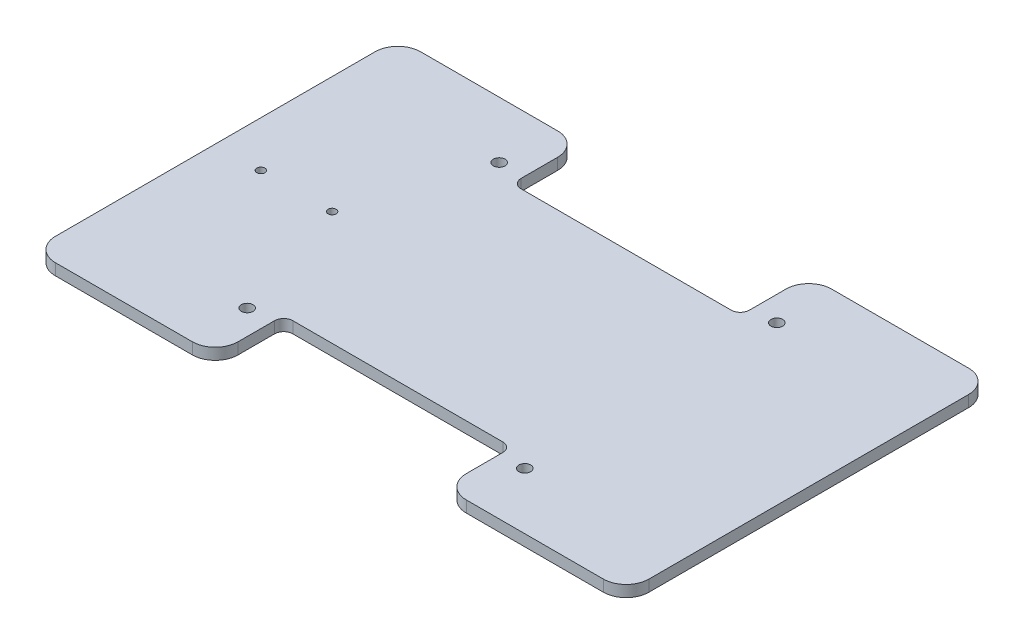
ISO-10303-21;
HEADER;
FILE_DESCRIPTION(('STEP AP214'),'2;1');
FILE_NAME('part.step','',(''),(''),'','','');
FILE_SCHEMA(('AUTOMOTIVE_DESIGN { 1 0 10303 214 1 1 1 1 }'));
ENDSEC;
DATA;
#1=APPLICATION_CONTEXT('core data for automotive mechanical design processes');
#2=APPLICATION_PROTOCOL_DEFINITION('international standard','automotive_design',2000,#1);
#3=PRODUCT_CONTEXT('',#1,'mechanical');
#4=PRODUCT('Part','Part','',(#3));
#5=PRODUCT_RELATED_PRODUCT_CATEGORY('part','',(#4));
#6=PRODUCT_DEFINITION_FORMATION('','',#4);
#7=PRODUCT_DEFINITION_CONTEXT('part definition',#1,'design');
#8=PRODUCT_DEFINITION('design','',#6,#7);
#9=PRODUCT_DEFINITION_SHAPE('','',#8);
#10=(LENGTH_UNIT() NAMED_UNIT(*) SI_UNIT(.MILLI.,.METRE.));
#11=(NAMED_UNIT(*) PLANE_ANGLE_UNIT() SI_UNIT($,.RADIAN.));
#12=(NAMED_UNIT(*) SI_UNIT($,.STERADIAN.) SOLID_ANGLE_UNIT());
#13=UNCERTAINTY_MEASURE_WITH_UNIT(LENGTH_MEASURE(1.E-05),#10,'distance_accuracy_value','');
#14=(GEOMETRIC_REPRESENTATION_CONTEXT(3) GLOBAL_UNCERTAINTY_ASSIGNED_CONTEXT((#13)) GLOBAL_UNIT_ASSIGNED_CONTEXT((#10,
#11,#12)) REPRESENTATION_CONTEXT('',''));
#15=CARTESIAN_POINT('',(0.,0.,0.));
#16=DIRECTION('',(0.,0.,1.));
#17=DIRECTION('',(1.,0.,0.));
#18=AXIS2_PLACEMENT_3D('',#15,#16,#17);
#19=CARTESIAN_POINT('',(-82.55,3.175,50.8));
#20=DIRECTION('',(0.,0.,-1.));
#21=DIRECTION('',(-1.,0.,0.));
#22=AXIS2_PLACEMENT_3D('',#19,#20,#21);
#23=PLANE('',#22);
#24=DIRECTION('',(0.,1.,0.));
#25=VECTOR('',#24,1.);
#26=CARTESIAN_POINT('',(-38.1,0.,50.8));
#27=LINE('',#26,#25);
#28=CARTESIAN_POINT('',(-38.1,0.,50.8));
#29=VERTEX_POINT('',#28);
#30=CARTESIAN_POINT('',(-38.1,3.175,50.8));
#31=VERTEX_POINT('',#30);
#32=EDGE_CURVE('E194',#29,#31,#27,.T.);
#33=ORIENTED_EDGE('',*,*,#32,.T.);
#34=DIRECTION('',(1.,0.,0.));
#35=VECTOR('',#34,1.);
#36=CARTESIAN_POINT('',(-82.55,3.175,50.8));
#37=LINE('',#36,#35);
#38=CARTESIAN_POINT('',(-76.2,3.175,50.8));
#39=VERTEX_POINT('',#38);
#40=EDGE_CURVE('E232',#39,#31,#37,.T.);
#41=ORIENTED_EDGE('',*,*,#40,.F.);
#42=DIRECTION('',(0.,-1.,0.));
#43=VECTOR('',#42,1.);
#44=CARTESIAN_POINT('',(-76.2,3.175,50.8));
#45=LINE('',#44,#43);
#46=CARTESIAN_POINT('',(-76.2,0.,50.8));
#47=VERTEX_POINT('',#46);
#48=EDGE_CURVE('E11',#39,#47,#45,.T.);
#49=ORIENTED_EDGE('',*,*,#48,.T.);
#50=DIRECTION('',(1.,0.,0.));
#51=VECTOR('',#50,1.);
#52=CARTESIAN_POINT('',(-82.55,0.,50.8));
#53=LINE('',#52,#51);
#54=EDGE_CURVE('E212',#47,#29,#53,.T.);
#55=ORIENTED_EDGE('',*,*,#54,.T.);
#56=EDGE_LOOP('',(#33,#41,#49,#55));
#57=FACE_BOUND('',#56,.T.);
#58=ADVANCED_FACE('F33',(#57),#23,.F.);
#59=CARTESIAN_POINT('',(-82.55,3.175,-50.8));
#60=DIRECTION('',(0.,0.,1.));
#61=DIRECTION('',(1.,0.,0.));
#62=AXIS2_PLACEMENT_3D('',#59,#60,#61);
#63=PLANE('',#62);
#64=DIRECTION('',(0.,1.,0.));
#65=VECTOR('',#64,1.);
#66=CARTESIAN_POINT('',(38.1,0.,-50.8));
#67=LINE('',#66,#65);
#68=CARTESIAN_POINT('',(38.1,0.,-50.8));
#69=VERTEX_POINT('',#68);
#70=CARTESIAN_POINT('',(38.1,3.175,-50.8));
#71=VERTEX_POINT('',#70);
#72=EDGE_CURVE('E297',#69,#71,#67,.T.);
#73=ORIENTED_EDGE('',*,*,#72,.T.);
#74=DIRECTION('',(-1.,0.,0.));
#75=VECTOR('',#74,1.);
#76=CARTESIAN_POINT('',(-82.55,3.175,-50.8));
#77=LINE('',#76,#75);
#78=CARTESIAN_POINT('',(76.2,3.175,-50.8));
#79=VERTEX_POINT('',#78);
#80=EDGE_CURVE('E291',#79,#71,#77,.T.);
#81=ORIENTED_EDGE('',*,*,#80,.F.);
#82=DIRECTION('',(0.,-1.,0.));
#83=VECTOR('',#82,1.);
#84=CARTESIAN_POINT('',(76.2,3.175,-50.8));
#85=LINE('',#84,#83);
#86=CARTESIAN_POINT('',(76.2,0.,-50.8));
#87=VERTEX_POINT('',#86);
#88=EDGE_CURVE('E245',#79,#87,#85,.T.);
#89=ORIENTED_EDGE('',*,*,#88,.T.);
#90=DIRECTION('',(-1.,0.,0.));
#91=VECTOR('',#90,1.);
#92=CARTESIAN_POINT('',(-82.55,0.,-50.8));
#93=LINE('',#92,#91);
#94=EDGE_CURVE('E307',#87,#69,#93,.T.);
#95=ORIENTED_EDGE('',*,*,#94,.T.);
#96=EDGE_LOOP('',(#73,#81,#89,#95));
#97=FACE_BOUND('',#96,.T.);
#98=ADVANCED_FACE('F294',(#97),#63,.F.);
#99=CARTESIAN_POINT('',(82.55,3.175,50.8));
#100=DIRECTION('',(-1.,0.,0.));
#101=DIRECTION('',(0.,0.,1.));
#102=AXIS2_PLACEMENT_3D('',#99,#100,#101);
#103=PLANE('',#102);
#104=DIRECTION('',(0.,0.,-1.));
#105=VECTOR('',#104,1.);
#106=CARTESIAN_POINT('',(82.55,0.,50.8));
#107=LINE('',#106,#105);
#108=CARTESIAN_POINT('',(82.55,0.,44.45));
#109=VERTEX_POINT('',#108);
#110=CARTESIAN_POINT('',(82.55,0.,-44.45));
#111=VERTEX_POINT('',#110);
#112=EDGE_CURVE('E284',#109,#111,#107,.T.);
#113=ORIENTED_EDGE('',*,*,#112,.T.);
#114=DIRECTION('',(0.,-1.,0.));
#115=VECTOR('',#114,1.);
#116=CARTESIAN_POINT('',(82.55,3.175,-44.45));
#117=LINE('',#116,#115);
#118=CARTESIAN_POINT('',(82.55,3.175,-44.45));
#119=VERTEX_POINT('',#118);
#120=EDGE_CURVE('E262',#111,#119,#117,.F.);
#121=ORIENTED_EDGE('',*,*,#120,.T.);
#122=DIRECTION('',(0.,0.,-1.));
#123=VECTOR('',#122,1.);
#124=CARTESIAN_POINT('',(82.55,3.175,50.8));
#125=LINE('',#124,#123);
#126=CARTESIAN_POINT('',(82.55,3.175,44.45));
#127=VERTEX_POINT('',#126);
#128=EDGE_CURVE('E219',#127,#119,#125,.T.);
#129=ORIENTED_EDGE('',*,*,#128,.F.);
#130=DIRECTION('',(0.,-1.,0.));
#131=VECTOR('',#130,1.);
#132=CARTESIAN_POINT('',(82.55,3.175,44.45));
#133=LINE('',#132,#131);
#134=EDGE_CURVE('E259',#127,#109,#133,.T.);
#135=ORIENTED_EDGE('',*,*,#134,.T.);
#136=EDGE_LOOP('',(#113,#121,#129,#135));
#137=FACE_BOUND('',#136,.T.);
#138=ADVANCED_FACE('F281',(#137),#103,.F.);
#139=CARTESIAN_POINT('',(-38.1,3.175,-50.8));
#140=VERTEX_POINT('',#139);
#141=CARTESIAN_POINT('',(-76.2,3.175,-50.8));
#142=VERTEX_POINT('',#141);
#143=EDGE_CURVE('E223',#140,#142,#77,.T.);
#144=ORIENTED_EDGE('',*,*,#143,.F.);
#145=DIRECTION('',(0.,1.,0.));
#146=VECTOR('',#145,1.);
#147=CARTESIAN_POINT('',(-38.1,0.,-50.8));
#148=LINE('',#147,#146);
#149=CARTESIAN_POINT('',(-38.1,0.,-50.8));
#150=VERTEX_POINT('',#149);
#151=EDGE_CURVE('E316',#150,#140,#148,.T.);
#152=ORIENTED_EDGE('',*,*,#151,.F.);
#153=CARTESIAN_POINT('',(-76.2,0.,-50.8));
#154=VERTEX_POINT('',#153);
#155=EDGE_CURVE('E305',#150,#154,#93,.T.);
#156=ORIENTED_EDGE('',*,*,#155,.T.);
#157=DIRECTION('',(0.,-1.,0.));
#158=VECTOR('',#157,1.);
#159=CARTESIAN_POINT('',(-76.2,3.175,-50.8));
#160=LINE('',#159,#158);
#161=EDGE_CURVE('E248',#154,#142,#160,.F.);
#162=ORIENTED_EDGE('',*,*,#161,.T.);
#163=EDGE_LOOP('',(#144,#152,#156,#162));
#164=FACE_BOUND('',#163,.T.);
#165=ADVANCED_FACE('F313',(#164),#63,.F.);
#166=CARTESIAN_POINT('',(-82.55,3.175,50.8));
#167=DIRECTION('',(1.,0.,0.));
#168=DIRECTION('',(0.,0.,-1.));
#169=AXIS2_PLACEMENT_3D('',#166,#167,#168);
#170=PLANE('',#169);
#171=DIRECTION('',(0.,0.,1.));
#172=VECTOR('',#171,1.);
#173=CARTESIAN_POINT('',(-82.55,3.175,50.8));
#174=LINE('',#173,#172);
#175=CARTESIAN_POINT('',(-82.55,3.175,-44.45));
#176=VERTEX_POINT('',#175);
#177=CARTESIAN_POINT('',(-82.55,3.175,44.45));
#178=VERTEX_POINT('',#177);
#179=EDGE_CURVE('E298',#176,#178,#174,.T.);
#180=ORIENTED_EDGE('',*,*,#179,.F.);
#181=DIRECTION('',(0.,-1.,0.));
#182=VECTOR('',#181,1.);
#183=CARTESIAN_POINT('',(-82.55,3.175,-44.45));
#184=LINE('',#183,#182);
#185=CARTESIAN_POINT('',(-82.55,0.,-44.45));
#186=VERTEX_POINT('',#185);
#187=EDGE_CURVE('E231',#176,#186,#184,.T.);
#188=ORIENTED_EDGE('',*,*,#187,.T.);
#189=DIRECTION('',(0.,0.,1.));
#190=VECTOR('',#189,1.);
#191=CARTESIAN_POINT('',(-82.55,0.,50.8));
#192=LINE('',#191,#190);
#193=CARTESIAN_POINT('',(-82.55,0.,44.45));
#194=VERTEX_POINT('',#193);
#195=EDGE_CURVE('E225',#186,#194,#192,.T.);
#196=ORIENTED_EDGE('',*,*,#195,.T.);
#197=DIRECTION('',(0.,-1.,0.));
#198=VECTOR('',#197,1.);
#199=CARTESIAN_POINT('',(-82.55,3.175,44.45));
#200=LINE('',#199,#198);
#201=EDGE_CURVE('E229',#194,#178,#200,.F.);
#202=ORIENTED_EDGE('',*,*,#201,.T.);
#203=EDGE_LOOP('',(#180,#188,#196,#202));
#204=FACE_BOUND('',#203,.T.);
#205=ADVANCED_FACE('F326',(#204),#170,.F.);
#206=CARTESIAN_POINT('',(38.1,3.175,50.8));
#207=VERTEX_POINT('',#206);
#208=CARTESIAN_POINT('',(76.2,3.175,50.8));
#209=VERTEX_POINT('',#208);
#210=EDGE_CURVE('E270',#207,#209,#37,.T.);
#211=ORIENTED_EDGE('',*,*,#210,.F.);
#212=DIRECTION('',(0.,1.,0.));
#213=VECTOR('',#212,1.);
#214=CARTESIAN_POINT('',(38.1,0.,50.8));
#215=LINE('',#214,#213);
#216=CARTESIAN_POINT('',(38.1,0.,50.8));
#217=VERTEX_POINT('',#216);
#218=EDGE_CURVE('E205',#217,#207,#215,.T.);
#219=ORIENTED_EDGE('',*,*,#218,.F.);
#220=CARTESIAN_POINT('',(76.2,0.,50.8));
#221=VERTEX_POINT('',#220);
#222=EDGE_CURVE('E220',#217,#221,#53,.T.);
#223=ORIENTED_EDGE('',*,*,#222,.T.);
#224=DIRECTION('',(0.,-1.,0.));
#225=VECTOR('',#224,1.);
#226=CARTESIAN_POINT('',(76.2,3.175,50.8));
#227=LINE('',#226,#225);
#228=EDGE_CURVE('E41',#221,#209,#227,.F.);
#229=ORIENTED_EDGE('',*,*,#228,.T.);
#230=EDGE_LOOP('',(#211,#219,#223,#229));
#231=FACE_BOUND('',#230,.T.);
#232=ADVANCED_FACE('F268',(#231),#23,.F.);
#233=CARTESIAN_POINT('',(0.,3.175,0.));
#234=DIRECTION('',(0.,-1.,0.));
#235=DIRECTION('',(0.,0.,-1.));
#236=AXIS2_PLACEMENT_3D('',#233,#234,#235);
#237=PLANE('',#236);
#238=CARTESIAN_POINT('',(-69.85,3.175,0.));
#239=DIRECTION('',(0.,1.,0.));
#240=DIRECTION('',(0.,0.,1.));
#241=AXIS2_PLACEMENT_3D('',#238,#239,#240);
#242=CIRCLE('',#241,1.1303);
#243=CARTESIAN_POINT('',(-69.85,3.175,1.1303));
#244=VERTEX_POINT('',#243);
#245=EDGE_CURVE('E745',#244,#244,#242,.T.);
#246=ORIENTED_EDGE('',*,*,#245,.F.);
#247=EDGE_LOOP('',(#246));
#248=FACE_BOUND('',#247,.T.);
#249=CARTESIAN_POINT('',(-50.038,3.175,0.));
#250=DIRECTION('',(0.,1.,0.));
#251=DIRECTION('',(0.,0.,1.));
#252=AXIS2_PLACEMENT_3D('',#249,#250,#251);
#253=CIRCLE('',#252,1.1303);
#254=CARTESIAN_POINT('',(-50.038,3.175,1.1303));
#255=VERTEX_POINT('',#254);
#256=EDGE_CURVE('E340',#255,#255,#253,.T.);
#257=ORIENTED_EDGE('',*,*,#256,.F.);
#258=EDGE_LOOP('',(#257));
#259=FACE_BOUND('',#258,.T.);
#260=CARTESIAN_POINT('',(-38.608,3.175,-35.052));
#261=DIRECTION('',(0.,1.,0.));
#262=DIRECTION('',(0.,0.,1.));
#263=AXIS2_PLACEMENT_3D('',#260,#261,#262);
#264=CIRCLE('',#263,1.63194999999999);
#265=CARTESIAN_POINT('',(-38.608,3.175,-33.42005));
#266=VERTEX_POINT('',#265);
#267=EDGE_CURVE('E410',#266,#266,#264,.T.);
#268=ORIENTED_EDGE('',*,*,#267,.F.);
#269=EDGE_LOOP('',(#268));
#270=FACE_BOUND('',#269,.T.);
#271=CARTESIAN_POINT('',(38.6079999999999,3.175,-35.052));
#272=DIRECTION('',(0.,1.,0.));
#273=DIRECTION('',(0.,0.,1.));
#274=AXIS2_PLACEMENT_3D('',#271,#272,#273);
#275=CIRCLE('',#274,1.63194999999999);
#276=CARTESIAN_POINT('',(38.6079999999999,3.175,-33.42005));
#277=VERTEX_POINT('',#276);
#278=EDGE_CURVE('E428',#277,#277,#275,.T.);
#279=ORIENTED_EDGE('',*,*,#278,.F.);
#280=EDGE_LOOP('',(#279));
#281=FACE_BOUND('',#280,.T.);
#282=CARTESIAN_POINT('',(38.6079999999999,3.175,35.052));
#283=DIRECTION('',(0.,1.,0.));
#284=DIRECTION('',(0.,0.,1.));
#285=AXIS2_PLACEMENT_3D('',#282,#283,#284);
#286=CIRCLE('',#285,1.63194999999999);
#287=CARTESIAN_POINT('',(38.6079999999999,3.175,36.68395));
#288=VERTEX_POINT('',#287);
#289=EDGE_CURVE('E434',#288,#288,#286,.T.);
#290=ORIENTED_EDGE('',*,*,#289,.F.);
#291=EDGE_LOOP('',(#290));
#292=FACE_BOUND('',#291,.T.);
#293=CARTESIAN_POINT('',(-38.608,3.175,35.052));
#294=DIRECTION('',(0.,1.,0.));
#295=DIRECTION('',(0.,0.,1.));
#296=AXIS2_PLACEMENT_3D('',#293,#294,#295);
#297=CIRCLE('',#296,1.63194999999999);
#298=CARTESIAN_POINT('',(-38.608,3.175,36.68395));
#299=VERTEX_POINT('',#298);
#300=EDGE_CURVE('E440',#299,#299,#297,.T.);
#301=ORIENTED_EDGE('',*,*,#300,.F.);
#302=EDGE_LOOP('',(#301));
#303=FACE_BOUND('',#302,.T.);
#304=ORIENTED_EDGE('',*,*,#40,.T.);
#305=CARTESIAN_POINT('',(-38.1,3.175,44.45));
#306=DIRECTION('',(0.,-1.,0.));
#307=DIRECTION('',(0.,0.,1.));
#308=AXIS2_PLACEMENT_3D('',#305,#306,#307);
#309=CIRCLE('',#308,6.35);
#310=CARTESIAN_POINT('',(-31.75,3.175,44.45));
#311=VERTEX_POINT('',#310);
#312=EDGE_CURVE('E200',#311,#31,#309,.T.);
#313=ORIENTED_EDGE('',*,*,#312,.F.);
#314=DIRECTION('',(0.,0.,1.));
#315=VECTOR('',#314,1.);
#316=CARTESIAN_POINT('',(-31.75,3.175,34.29));
#317=LINE('',#316,#315);
#318=CARTESIAN_POINT('',(-31.75,3.175,34.29));
#319=VERTEX_POINT('',#318);
#320=EDGE_CURVE('E216',#319,#311,#317,.T.);
#321=ORIENTED_EDGE('',*,*,#320,.F.);
#322=CARTESIAN_POINT('',(-29.21,3.175,34.29));
#323=DIRECTION('',(0.,1.,0.));
#324=DIRECTION('',(0.,0.,1.));
#325=AXIS2_PLACEMENT_3D('',#322,#323,#324);
#326=CIRCLE('',#325,2.54);
#327=CARTESIAN_POINT('',(-29.21,3.175,31.75));
#328=VERTEX_POINT('',#327);
#329=EDGE_CURVE('E353',#328,#319,#326,.T.);
#330=ORIENTED_EDGE('',*,*,#329,.F.);
#331=DIRECTION('',(-1.,0.,0.));
#332=VECTOR('',#331,1.);
#333=CARTESIAN_POINT('',(29.21,3.175,31.75));
#334=LINE('',#333,#332);
#335=CARTESIAN_POINT('',(29.21,3.175,31.75));
#336=VERTEX_POINT('',#335);
#337=EDGE_CURVE('E350',#336,#328,#334,.T.);
#338=ORIENTED_EDGE('',*,*,#337,.F.);
#339=CARTESIAN_POINT('',(29.21,3.175,34.29));
#340=DIRECTION('',(0.,1.,0.));
#341=DIRECTION('',(0.,0.,1.));
#342=AXIS2_PLACEMENT_3D('',#339,#340,#341);
#343=CIRCLE('',#342,2.54);
#344=CARTESIAN_POINT('',(31.75,3.175,34.29));
#345=VERTEX_POINT('',#344);
#346=EDGE_CURVE('E347',#345,#336,#343,.T.);
#347=ORIENTED_EDGE('',*,*,#346,.F.);
#348=DIRECTION('',(0.,0.,-1.));
#349=VECTOR('',#348,1.);
#350=CARTESIAN_POINT('',(31.75,3.175,34.29));
#351=LINE('',#350,#349);
#352=CARTESIAN_POINT('',(31.75,3.175,44.45));
#353=VERTEX_POINT('',#352);
#354=EDGE_CURVE('E337',#353,#345,#351,.T.);
#355=ORIENTED_EDGE('',*,*,#354,.F.);
#356=CARTESIAN_POINT('',(38.1,3.175,44.45));
#357=DIRECTION('',(0.,-1.,0.));
#358=DIRECTION('',(0.,0.,1.));
#359=AXIS2_PLACEMENT_3D('',#356,#357,#358);
#360=CIRCLE('',#359,6.35000000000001);
#361=EDGE_CURVE('E333',#207,#353,#360,.T.);
#362=ORIENTED_EDGE('',*,*,#361,.F.);
#363=ORIENTED_EDGE('',*,*,#210,.T.);
#364=CARTESIAN_POINT('',(76.2,3.175,44.45));
#365=DIRECTION('',(0.,-1.,0.));
#366=DIRECTION('',(0.,0.,-1.));
#367=AXIS2_PLACEMENT_3D('',#364,#365,#366);
#368=CIRCLE('',#367,6.35);
#369=EDGE_CURVE('E251',#209,#127,#368,.F.);
#370=ORIENTED_EDGE('',*,*,#369,.T.);
#371=ORIENTED_EDGE('',*,*,#128,.T.);
#372=CARTESIAN_POINT('',(76.2,3.175,-44.45));
#373=DIRECTION('',(0.,-1.,0.));
#374=DIRECTION('',(0.,0.,-1.));
#375=AXIS2_PLACEMENT_3D('',#372,#373,#374);
#376=CIRCLE('',#375,6.35);
#377=EDGE_CURVE('E255',#119,#79,#376,.F.);
#378=ORIENTED_EDGE('',*,*,#377,.T.);
#379=ORIENTED_EDGE('',*,*,#80,.T.);
#380=CARTESIAN_POINT('',(38.1,3.175,-44.45));
#381=DIRECTION('',(0.,-1.,0.));
#382=DIRECTION('',(0.,0.,1.));
#383=AXIS2_PLACEMENT_3D('',#380,#381,#382);
#384=CIRCLE('',#383,6.35);
#385=CARTESIAN_POINT('',(31.75,3.175,-44.45));
#386=VERTEX_POINT('',#385);
#387=EDGE_CURVE('E374',#386,#71,#384,.T.);
#388=ORIENTED_EDGE('',*,*,#387,.F.);
#389=DIRECTION('',(0.,0.,-1.));
#390=VECTOR('',#389,1.);
#391=CARTESIAN_POINT('',(31.75,3.175,-34.29));
#392=LINE('',#391,#390);
#393=CARTESIAN_POINT('',(31.75,3.175,-34.29));
#394=VERTEX_POINT('',#393);
#395=EDGE_CURVE('E405',#394,#386,#392,.T.);
#396=ORIENTED_EDGE('',*,*,#395,.F.);
#397=CARTESIAN_POINT('',(29.21,3.175,-34.29));
#398=DIRECTION('',(0.,1.,0.));
#399=DIRECTION('',(0.,0.,1.));
#400=AXIS2_PLACEMENT_3D('',#397,#398,#399);
#401=CIRCLE('',#400,2.54);
#402=CARTESIAN_POINT('',(29.21,3.175,-31.75));
#403=VERTEX_POINT('',#402);
#404=EDGE_CURVE('E402',#403,#394,#401,.T.);
#405=ORIENTED_EDGE('',*,*,#404,.F.);
#406=DIRECTION('',(1.,0.,0.));
#407=VECTOR('',#406,1.);
#408=CARTESIAN_POINT('',(29.21,3.175,-31.75));
#409=LINE('',#408,#407);
#410=CARTESIAN_POINT('',(-29.21,3.175,-31.75));
#411=VERTEX_POINT('',#410);
#412=EDGE_CURVE('E399',#411,#403,#409,.T.);
#413=ORIENTED_EDGE('',*,*,#412,.F.);
#414=CARTESIAN_POINT('',(-29.21,3.175,-34.29));
#415=DIRECTION('',(0.,1.,0.));
#416=DIRECTION('',(0.,0.,1.));
#417=AXIS2_PLACEMENT_3D('',#414,#415,#416);
#418=CIRCLE('',#417,2.54);
#419=CARTESIAN_POINT('',(-31.75,3.175,-34.29));
#420=VERTEX_POINT('',#419);
#421=EDGE_CURVE('E396',#420,#411,#418,.T.);
#422=ORIENTED_EDGE('',*,*,#421,.F.);
#423=DIRECTION('',(0.,0.,1.));
#424=VECTOR('',#423,1.);
#425=CARTESIAN_POINT('',(-31.75,3.175,-34.29));
#426=LINE('',#425,#424);
#427=CARTESIAN_POINT('',(-31.75,3.175,-44.45));
#428=VERTEX_POINT('',#427);
#429=EDGE_CURVE('E393',#428,#420,#426,.T.);
#430=ORIENTED_EDGE('',*,*,#429,.F.);
#431=CARTESIAN_POINT('',(-38.1,3.175,-44.45));
#432=DIRECTION('',(0.,-1.,0.));
#433=DIRECTION('',(0.,0.,1.));
#434=AXIS2_PLACEMENT_3D('',#431,#432,#433);
#435=CIRCLE('',#434,6.34999999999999);
#436=EDGE_CURVE('E359',#140,#428,#435,.T.);
#437=ORIENTED_EDGE('',*,*,#436,.F.);
#438=ORIENTED_EDGE('',*,*,#143,.T.);
#439=CARTESIAN_POINT('',(-76.2,3.175,-44.45));
#440=DIRECTION('',(0.,-1.,0.));
#441=DIRECTION('',(0.,0.,-1.));
#442=AXIS2_PLACEMENT_3D('',#439,#440,#441);
#443=CIRCLE('',#442,6.35);
#444=EDGE_CURVE('E257',#142,#176,#443,.F.);
#445=ORIENTED_EDGE('',*,*,#444,.T.);
#446=ORIENTED_EDGE('',*,*,#179,.T.);
#447=CARTESIAN_POINT('',(-76.2,3.175,44.45));
#448=DIRECTION('',(0.,-1.,0.));
#449=DIRECTION('',(0.,0.,-1.));
#450=AXIS2_PLACEMENT_3D('',#447,#448,#449);
#451=CIRCLE('',#450,6.35);
#452=EDGE_CURVE('E253',#178,#39,#451,.F.);
#453=ORIENTED_EDGE('',*,*,#452,.T.);
#454=EDGE_LOOP('',(#304,#313,#321,#330,#338,#347,#355,#362,#363,#370,#371,#378,#379,#388,#396,
#405,#413,#422,#430,#437,#438,#445,#446,#453));
#455=FACE_BOUND('',#454,.T.);
#456=ADVANCED_FACE('F276',(#248,#259,#270,#281,#292,#303,#455),#237,.F.);
#457=CARTESIAN_POINT('',(0.,0.,0.));
#458=DIRECTION('',(0.,-1.,0.));
#459=DIRECTION('',(0.,0.,-1.));
#460=AXIS2_PLACEMENT_3D('',#457,#458,#459);
#461=PLANE('',#460);
#462=CARTESIAN_POINT('',(-69.85,0.,0.));
#463=DIRECTION('',(0.,1.,0.));
#464=DIRECTION('',(0.,0.,1.));
#465=AXIS2_PLACEMENT_3D('',#462,#463,#464);
#466=CIRCLE('',#465,1.1303);
#467=CARTESIAN_POINT('',(-69.85,0.,1.1303));
#468=VERTEX_POINT('',#467);
#469=EDGE_CURVE('E743',#468,#468,#466,.T.);
#470=ORIENTED_EDGE('',*,*,#469,.T.);
#471=EDGE_LOOP('',(#470));
#472=FACE_BOUND('',#471,.T.);
#473=CARTESIAN_POINT('',(-50.038,0.,0.));
#474=DIRECTION('',(0.,1.,0.));
#475=DIRECTION('',(0.,0.,1.));
#476=AXIS2_PLACEMENT_3D('',#473,#474,#475);
#477=CIRCLE('',#476,1.1303);
#478=CARTESIAN_POINT('',(-50.038,0.,1.1303));
#479=VERTEX_POINT('',#478);
#480=EDGE_CURVE('E334',#479,#479,#477,.T.);
#481=ORIENTED_EDGE('',*,*,#480,.T.);
#482=EDGE_LOOP('',(#481));
#483=FACE_BOUND('',#482,.T.);
#484=CARTESIAN_POINT('',(-38.1,0.,44.45));
#485=DIRECTION('',(0.,-1.,0.));
#486=DIRECTION('',(0.,0.,1.));
#487=AXIS2_PLACEMENT_3D('',#484,#485,#486);
#488=CIRCLE('',#487,6.35);
#489=CARTESIAN_POINT('',(-31.75,0.,44.45));
#490=VERTEX_POINT('',#489);
#491=EDGE_CURVE('E197',#490,#29,#488,.T.);
#492=ORIENTED_EDGE('',*,*,#491,.T.);
#493=ORIENTED_EDGE('',*,*,#54,.F.);
#494=CARTESIAN_POINT('',(-76.2,0.,44.45));
#495=DIRECTION('',(0.,-1.,0.));
#496=DIRECTION('',(0.,0.,-1.));
#497=AXIS2_PLACEMENT_3D('',#494,#495,#496);
#498=CIRCLE('',#497,6.35);
#499=EDGE_CURVE('E238',#47,#194,#498,.T.);
#500=ORIENTED_EDGE('',*,*,#499,.T.);
#501=ORIENTED_EDGE('',*,*,#195,.F.);
#502=CARTESIAN_POINT('',(-76.2,0.,-44.45));
#503=DIRECTION('',(0.,-1.,0.));
#504=DIRECTION('',(0.,0.,-1.));
#505=AXIS2_PLACEMENT_3D('',#502,#503,#504);
#506=CIRCLE('',#505,6.35);
#507=EDGE_CURVE('E242',#186,#154,#506,.T.);
#508=ORIENTED_EDGE('',*,*,#507,.T.);
#509=ORIENTED_EDGE('',*,*,#155,.F.);
#510=CARTESIAN_POINT('',(-38.1,0.,-44.45));
#511=DIRECTION('',(0.,-1.,0.));
#512=DIRECTION('',(0.,0.,1.));
#513=AXIS2_PLACEMENT_3D('',#510,#511,#512);
#514=CIRCLE('',#513,6.34999999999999);
#515=CARTESIAN_POINT('',(-31.75,0.,-44.45));
#516=VERTEX_POINT('',#515);
#517=EDGE_CURVE('E371',#150,#516,#514,.T.);
#518=ORIENTED_EDGE('',*,*,#517,.T.);
#519=DIRECTION('',(0.,0.,1.));
#520=VECTOR('',#519,1.);
#521=CARTESIAN_POINT('',(-31.75,0.,-34.29));
#522=LINE('',#521,#520);
#523=CARTESIAN_POINT('',(-31.75,0.,-34.29));
#524=VERTEX_POINT('',#523);
#525=EDGE_CURVE('E373',#516,#524,#522,.T.);
#526=ORIENTED_EDGE('',*,*,#525,.T.);
#527=CARTESIAN_POINT('',(-29.21,0.,-34.29));
#528=DIRECTION('',(0.,1.,0.));
#529=DIRECTION('',(0.,0.,1.));
#530=AXIS2_PLACEMENT_3D('',#527,#528,#529);
#531=CIRCLE('',#530,2.54);
#532=CARTESIAN_POINT('',(-29.21,0.,-31.75));
#533=VERTEX_POINT('',#532);
#534=EDGE_CURVE('E56',#524,#533,#531,.T.);
#535=ORIENTED_EDGE('',*,*,#534,.T.);
#536=DIRECTION('',(1.,0.,0.));
#537=VECTOR('',#536,1.);
#538=CARTESIAN_POINT('',(29.21,0.,-31.75));
#539=LINE('',#538,#537);
#540=CARTESIAN_POINT('',(29.21,0.,-31.75));
#541=VERTEX_POINT('',#540);
#542=EDGE_CURVE('E378',#533,#541,#539,.T.);
#543=ORIENTED_EDGE('',*,*,#542,.T.);
#544=CARTESIAN_POINT('',(29.21,0.,-34.29));
#545=DIRECTION('',(0.,1.,0.));
#546=DIRECTION('',(0.,0.,1.));
#547=AXIS2_PLACEMENT_3D('',#544,#545,#546);
#548=CIRCLE('',#547,2.54);
#549=CARTESIAN_POINT('',(31.75,0.,-34.29));
#550=VERTEX_POINT('',#549);
#551=EDGE_CURVE('E381',#541,#550,#548,.T.);
#552=ORIENTED_EDGE('',*,*,#551,.T.);
#553=DIRECTION('',(0.,0.,-1.));
#554=VECTOR('',#553,1.);
#555=CARTESIAN_POINT('',(31.75,0.,-34.29));
#556=LINE('',#555,#554);
#557=CARTESIAN_POINT('',(31.75,0.,-44.45));
#558=VERTEX_POINT('',#557);
#559=EDGE_CURVE('E384',#550,#558,#556,.T.);
#560=ORIENTED_EDGE('',*,*,#559,.T.);
#561=CARTESIAN_POINT('',(38.1,0.,-44.45));
#562=DIRECTION('',(0.,-1.,0.));
#563=DIRECTION('',(0.,0.,1.));
#564=AXIS2_PLACEMENT_3D('',#561,#562,#563);
#565=CIRCLE('',#564,6.35);
#566=EDGE_CURVE('E387',#558,#69,#565,.T.);
#567=ORIENTED_EDGE('',*,*,#566,.T.);
#568=ORIENTED_EDGE('',*,*,#94,.F.);
#569=CARTESIAN_POINT('',(76.2,0.,-44.45));
#570=DIRECTION('',(0.,-1.,0.));
#571=DIRECTION('',(0.,0.,-1.));
#572=AXIS2_PLACEMENT_3D('',#569,#570,#571);
#573=CIRCLE('',#572,6.35);
#574=EDGE_CURVE('E240',#87,#111,#573,.T.);
#575=ORIENTED_EDGE('',*,*,#574,.T.);
#576=ORIENTED_EDGE('',*,*,#112,.F.);
#577=CARTESIAN_POINT('',(76.2,0.,44.45));
#578=DIRECTION('',(0.,-1.,0.));
#579=DIRECTION('',(0.,0.,-1.));
#580=AXIS2_PLACEMENT_3D('',#577,#578,#579);
#581=CIRCLE('',#580,6.35);
#582=EDGE_CURVE('E235',#109,#221,#581,.T.);
#583=ORIENTED_EDGE('',*,*,#582,.T.);
#584=ORIENTED_EDGE('',*,*,#222,.F.);
#585=CARTESIAN_POINT('',(38.1,0.,44.45));
#586=DIRECTION('',(0.,-1.,0.));
#587=DIRECTION('',(0.,0.,1.));
#588=AXIS2_PLACEMENT_3D('',#585,#586,#587);
#589=CIRCLE('',#588,6.35000000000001);
#590=CARTESIAN_POINT('',(31.75,0.,44.45));
#591=VERTEX_POINT('',#590);
#592=EDGE_CURVE('E215',#217,#591,#589,.T.);
#593=ORIENTED_EDGE('',*,*,#592,.T.);
#594=DIRECTION('',(0.,0.,-1.));
#595=VECTOR('',#594,1.);
#596=CARTESIAN_POINT('',(31.75,0.,34.29));
#597=LINE('',#596,#595);
#598=CARTESIAN_POINT('',(31.75,0.,34.29));
#599=VERTEX_POINT('',#598);
#600=EDGE_CURVE('E48',#591,#599,#597,.T.);
#601=ORIENTED_EDGE('',*,*,#600,.T.);
#602=CARTESIAN_POINT('',(29.21,0.,34.29));
#603=DIRECTION('',(0.,1.,0.));
#604=DIRECTION('',(0.,0.,1.));
#605=AXIS2_PLACEMENT_3D('',#602,#603,#604);
#606=CIRCLE('',#605,2.54);
#607=CARTESIAN_POINT('',(29.21,0.,31.75));
#608=VERTEX_POINT('',#607);
#609=EDGE_CURVE('E754',#599,#608,#606,.T.);
#610=ORIENTED_EDGE('',*,*,#609,.T.);
#611=DIRECTION('',(-1.,0.,0.));
#612=VECTOR('',#611,1.);
#613=CARTESIAN_POINT('',(29.21,0.,31.75));
#614=LINE('',#613,#612);
#615=CARTESIAN_POINT('',(-29.21,0.,31.75));
#616=VERTEX_POINT('',#615);
#617=EDGE_CURVE('E757',#608,#616,#614,.T.);
#618=ORIENTED_EDGE('',*,*,#617,.T.);
#619=CARTESIAN_POINT('',(-29.21,0.,34.29));
#620=DIRECTION('',(0.,1.,0.));
#621=DIRECTION('',(0.,0.,1.));
#622=AXIS2_PLACEMENT_3D('',#619,#620,#621);
#623=CIRCLE('',#622,2.54);
#624=CARTESIAN_POINT('',(-31.75,0.,34.29));
#625=VERTEX_POINT('',#624);
#626=EDGE_CURVE('E759',#616,#625,#623,.T.);
#627=ORIENTED_EDGE('',*,*,#626,.T.);
#628=DIRECTION('',(0.,0.,1.));
#629=VECTOR('',#628,1.);
#630=CARTESIAN_POINT('',(-31.75,0.,34.29));
#631=LINE('',#630,#629);
#632=EDGE_CURVE('E206',#625,#490,#631,.T.);
#633=ORIENTED_EDGE('',*,*,#632,.T.);
#634=EDGE_LOOP('',(#492,#493,#500,#501,#508,#509,#518,#526,#535,#543,#552,#560,#567,#568,#575,
#576,#583,#584,#593,#601,#610,#618,#627,#633));
#635=FACE_BOUND('',#634,.T.);
#636=CARTESIAN_POINT('',(-38.608,0.,-35.052));
#637=DIRECTION('',(0.,1.,0.));
#638=DIRECTION('',(0.,0.,1.));
#639=AXIS2_PLACEMENT_3D('',#636,#637,#638);
#640=CIRCLE('',#639,1.63195);
#641=CARTESIAN_POINT('',(-38.608,0.,-33.42005));
#642=VERTEX_POINT('',#641);
#643=EDGE_CURVE('E425',#642,#642,#640,.T.);
#644=ORIENTED_EDGE('',*,*,#643,.T.);
#645=EDGE_LOOP('',(#644));
#646=FACE_BOUND('',#645,.T.);
#647=CARTESIAN_POINT('',(38.6079999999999,0.,-35.052));
#648=DIRECTION('',(0.,1.,0.));
#649=DIRECTION('',(0.,0.,1.));
#650=AXIS2_PLACEMENT_3D('',#647,#648,#649);
#651=CIRCLE('',#650,1.63195);
#652=CARTESIAN_POINT('',(38.6079999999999,0.,-33.42005));
#653=VERTEX_POINT('',#652);
#654=EDGE_CURVE('E431',#653,#653,#651,.T.);
#655=ORIENTED_EDGE('',*,*,#654,.T.);
#656=EDGE_LOOP('',(#655));
#657=FACE_BOUND('',#656,.T.);
#658=CARTESIAN_POINT('',(38.6079999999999,0.,35.052));
#659=DIRECTION('',(0.,1.,0.));
#660=DIRECTION('',(0.,0.,1.));
#661=AXIS2_PLACEMENT_3D('',#658,#659,#660);
#662=CIRCLE('',#661,1.63195);
#663=CARTESIAN_POINT('',(38.6079999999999,0.,36.68395));
#664=VERTEX_POINT('',#663);
#665=EDGE_CURVE('E437',#664,#664,#662,.T.);
#666=ORIENTED_EDGE('',*,*,#665,.T.);
#667=EDGE_LOOP('',(#666));
#668=FACE_BOUND('',#667,.T.);
#669=CARTESIAN_POINT('',(-38.608,0.,35.052));
#670=DIRECTION('',(0.,1.,0.));
#671=DIRECTION('',(0.,0.,1.));
#672=AXIS2_PLACEMENT_3D('',#669,#670,#671);
#673=CIRCLE('',#672,1.63195);
#674=CARTESIAN_POINT('',(-38.608,0.,36.68395));
#675=VERTEX_POINT('',#674);
#676=EDGE_CURVE('E306',#675,#675,#673,.T.);
#677=ORIENTED_EDGE('',*,*,#676,.T.);
#678=EDGE_LOOP('',(#677));
#679=FACE_BOUND('',#678,.T.);
#680=ADVANCED_FACE('F210',(#472,#483,#635,#646,#657,#668,#679),#461,.T.);
#681=CARTESIAN_POINT('',(-76.2,3.175,-44.45));
#682=DIRECTION('',(0.,-1.,0.));
#683=DIRECTION('',(0.,0.,-1.));
#684=AXIS2_PLACEMENT_3D('',#681,#682,#683);
#685=CYLINDRICAL_SURFACE('',#684,6.35);
#686=ORIENTED_EDGE('',*,*,#444,.F.);
#687=ORIENTED_EDGE('',*,*,#161,.F.);
#688=ORIENTED_EDGE('',*,*,#507,.F.);
#689=ORIENTED_EDGE('',*,*,#187,.F.);
#690=EDGE_LOOP('',(#686,#687,#688,#689));
#691=FACE_BOUND('',#690,.T.);
#692=ADVANCED_FACE('F321',(#691),#685,.T.);
#693=CARTESIAN_POINT('',(76.2,3.175,-44.45));
#694=DIRECTION('',(0.,-1.,0.));
#695=DIRECTION('',(0.,0.,-1.));
#696=AXIS2_PLACEMENT_3D('',#693,#694,#695);
#697=CYLINDRICAL_SURFACE('',#696,6.35);
#698=ORIENTED_EDGE('',*,*,#377,.F.);
#699=ORIENTED_EDGE('',*,*,#120,.F.);
#700=ORIENTED_EDGE('',*,*,#574,.F.);
#701=ORIENTED_EDGE('',*,*,#88,.F.);
#702=EDGE_LOOP('',(#698,#699,#700,#701));
#703=FACE_BOUND('',#702,.T.);
#704=ADVANCED_FACE('F286',(#703),#697,.T.);
#705=CARTESIAN_POINT('',(-76.2,3.175,44.45));
#706=DIRECTION('',(0.,-1.,0.));
#707=DIRECTION('',(0.,0.,-1.));
#708=AXIS2_PLACEMENT_3D('',#705,#706,#707);
#709=CYLINDRICAL_SURFACE('',#708,6.35);
#710=ORIENTED_EDGE('',*,*,#452,.F.);
#711=ORIENTED_EDGE('',*,*,#201,.F.);
#712=ORIENTED_EDGE('',*,*,#499,.F.);
#713=ORIENTED_EDGE('',*,*,#48,.F.);
#714=EDGE_LOOP('',(#710,#711,#712,#713));
#715=FACE_BOUND('',#714,.T.);
#716=ADVANCED_FACE('F329',(#715),#709,.T.);
#717=CARTESIAN_POINT('',(76.2,3.175,44.45));
#718=DIRECTION('',(0.,-1.,0.));
#719=DIRECTION('',(0.,0.,-1.));
#720=AXIS2_PLACEMENT_3D('',#717,#718,#719);
#721=CYLINDRICAL_SURFACE('',#720,6.35);
#722=ORIENTED_EDGE('',*,*,#369,.F.);
#723=ORIENTED_EDGE('',*,*,#228,.F.);
#724=ORIENTED_EDGE('',*,*,#582,.F.);
#725=ORIENTED_EDGE('',*,*,#134,.F.);
#726=EDGE_LOOP('',(#722,#723,#724,#725));
#727=FACE_BOUND('',#726,.T.);
#728=ADVANCED_FACE('F35',(#727),#721,.T.);
#729=CARTESIAN_POINT('',(-38.608,3.175,35.052));
#730=DIRECTION('',(0.,1.,0.));
#731=DIRECTION('',(0.,0.,1.));
#732=AXIS2_PLACEMENT_3D('',#729,#730,#731);
#733=CYLINDRICAL_SURFACE('',#732,1.63194999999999);
#734=ORIENTED_EDGE('',*,*,#676,.F.);
#735=EDGE_LOOP('',(#734));
#736=FACE_BOUND('',#735,.T.);
#737=ORIENTED_EDGE('',*,*,#300,.T.);
#738=EDGE_LOOP('',(#737));
#739=FACE_BOUND('',#738,.T.);
#740=ADVANCED_FACE('F446',(#736,#739),#733,.F.);
#741=CARTESIAN_POINT('',(38.6079999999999,3.175,35.052));
#742=DIRECTION('',(0.,1.,0.));
#743=DIRECTION('',(0.,0.,1.));
#744=AXIS2_PLACEMENT_3D('',#741,#742,#743);
#745=CYLINDRICAL_SURFACE('',#744,1.63194999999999);
#746=ORIENTED_EDGE('',*,*,#665,.F.);
#747=EDGE_LOOP('',(#746));
#748=FACE_BOUND('',#747,.T.);
#749=ORIENTED_EDGE('',*,*,#289,.T.);
#750=EDGE_LOOP('',(#749));
#751=FACE_BOUND('',#750,.T.);
#752=ADVANCED_FACE('F449',(#748,#751),#745,.F.);
#753=CARTESIAN_POINT('',(38.6079999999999,3.175,-35.052));
#754=DIRECTION('',(0.,1.,0.));
#755=DIRECTION('',(0.,0.,1.));
#756=AXIS2_PLACEMENT_3D('',#753,#754,#755);
#757=CYLINDRICAL_SURFACE('',#756,1.63194999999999);
#758=ORIENTED_EDGE('',*,*,#654,.F.);
#759=EDGE_LOOP('',(#758));
#760=FACE_BOUND('',#759,.T.);
#761=ORIENTED_EDGE('',*,*,#278,.T.);
#762=EDGE_LOOP('',(#761));
#763=FACE_BOUND('',#762,.T.);
#764=ADVANCED_FACE('F495',(#760,#763),#757,.F.);
#765=CARTESIAN_POINT('',(-38.608,3.175,-35.052));
#766=DIRECTION('',(0.,1.,0.));
#767=DIRECTION('',(0.,0.,1.));
#768=AXIS2_PLACEMENT_3D('',#765,#766,#767);
#769=CYLINDRICAL_SURFACE('',#768,1.63194999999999);
#770=ORIENTED_EDGE('',*,*,#643,.F.);
#771=EDGE_LOOP('',(#770));
#772=FACE_BOUND('',#771,.T.);
#773=ORIENTED_EDGE('',*,*,#267,.T.);
#774=EDGE_LOOP('',(#773));
#775=FACE_BOUND('',#774,.T.);
#776=ADVANCED_FACE('F503',(#772,#775),#769,.F.);
#777=CARTESIAN_POINT('',(-38.1,0.,-44.45));
#778=DIRECTION('',(0.,1.,0.));
#779=DIRECTION('',(0.,0.,1.));
#780=AXIS2_PLACEMENT_3D('',#777,#778,#779);
#781=CYLINDRICAL_SURFACE('',#780,6.34999999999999);
#782=ORIENTED_EDGE('',*,*,#436,.T.);
#783=DIRECTION('',(0.,1.,0.));
#784=VECTOR('',#783,1.);
#785=CARTESIAN_POINT('',(-31.75,0.,-44.45));
#786=LINE('',#785,#784);
#787=EDGE_CURVE('E390',#516,#428,#786,.T.);
#788=ORIENTED_EDGE('',*,*,#787,.F.);
#789=ORIENTED_EDGE('',*,*,#517,.F.);
#790=ORIENTED_EDGE('',*,*,#151,.T.);
#791=EDGE_LOOP('',(#782,#788,#789,#790));
#792=FACE_BOUND('',#791,.T.);
#793=ADVANCED_FACE('F511',(#792),#781,.T.);
#794=CARTESIAN_POINT('',(38.1,0.,-44.45));
#795=DIRECTION('',(0.,1.,0.));
#796=DIRECTION('',(0.,0.,1.));
#797=AXIS2_PLACEMENT_3D('',#794,#795,#796);
#798=CYLINDRICAL_SURFACE('',#797,6.35);
#799=ORIENTED_EDGE('',*,*,#387,.T.);
#800=ORIENTED_EDGE('',*,*,#72,.F.);
#801=ORIENTED_EDGE('',*,*,#566,.F.);
#802=DIRECTION('',(0.,1.,0.));
#803=VECTOR('',#802,1.);
#804=CARTESIAN_POINT('',(31.75,0.,-44.45));
#805=LINE('',#804,#803);
#806=EDGE_CURVE('E412',#558,#386,#805,.T.);
#807=ORIENTED_EDGE('',*,*,#806,.T.);
#808=EDGE_LOOP('',(#799,#800,#801,#807));
#809=FACE_BOUND('',#808,.T.);
#810=ADVANCED_FACE('F519',(#809),#798,.T.);
#811=CARTESIAN_POINT('',(31.75,0.,-34.29));
#812=DIRECTION('',(1.,0.,0.));
#813=DIRECTION('',(0.,0.,-1.));
#814=AXIS2_PLACEMENT_3D('',#811,#812,#813);
#815=PLANE('',#814);
#816=ORIENTED_EDGE('',*,*,#395,.T.);
#817=ORIENTED_EDGE('',*,*,#806,.F.);
#818=ORIENTED_EDGE('',*,*,#559,.F.);
#819=DIRECTION('',(0.,1.,0.));
#820=VECTOR('',#819,1.);
#821=CARTESIAN_POINT('',(31.75,0.,-34.29));
#822=LINE('',#821,#820);
#823=EDGE_CURVE('E414',#550,#394,#822,.T.);
#824=ORIENTED_EDGE('',*,*,#823,.T.);
#825=EDGE_LOOP('',(#816,#817,#818,#824));
#826=FACE_BOUND('',#825,.T.);
#827=ADVANCED_FACE('F528',(#826),#815,.F.);
#828=CARTESIAN_POINT('',(29.21,0.,-34.29));
#829=DIRECTION('',(0.,1.,0.));
#830=DIRECTION('',(0.,0.,1.));
#831=AXIS2_PLACEMENT_3D('',#828,#829,#830);
#832=CYLINDRICAL_SURFACE('',#831,2.54);
#833=ORIENTED_EDGE('',*,*,#404,.T.);
#834=ORIENTED_EDGE('',*,*,#823,.F.);
#835=ORIENTED_EDGE('',*,*,#551,.F.);
#836=DIRECTION('',(0.,1.,0.));
#837=VECTOR('',#836,1.);
#838=CARTESIAN_POINT('',(29.21,0.,-31.75));
#839=LINE('',#838,#837);
#840=EDGE_CURVE('E416',#541,#403,#839,.T.);
#841=ORIENTED_EDGE('',*,*,#840,.T.);
#842=EDGE_LOOP('',(#833,#834,#835,#841));
#843=FACE_BOUND('',#842,.T.);
#844=ADVANCED_FACE('F536',(#843),#832,.F.);
#845=CARTESIAN_POINT('',(29.21,0.,-31.75));
#846=DIRECTION('',(0.,0.,1.));
#847=DIRECTION('',(1.,0.,0.));
#848=AXIS2_PLACEMENT_3D('',#845,#846,#847);
#849=PLANE('',#848);
#850=ORIENTED_EDGE('',*,*,#412,.T.);
#851=ORIENTED_EDGE('',*,*,#840,.F.);
#852=ORIENTED_EDGE('',*,*,#542,.F.);
#853=DIRECTION('',(0.,1.,0.));
#854=VECTOR('',#853,1.);
#855=CARTESIAN_POINT('',(-29.21,0.,-31.75));
#856=LINE('',#855,#854);
#857=EDGE_CURVE('E418',#533,#411,#856,.T.);
#858=ORIENTED_EDGE('',*,*,#857,.T.);
#859=EDGE_LOOP('',(#850,#851,#852,#858));
#860=FACE_BOUND('',#859,.T.);
#861=ADVANCED_FACE('F544',(#860),#849,.F.);
#862=CARTESIAN_POINT('',(-29.21,0.,-34.29));
#863=DIRECTION('',(0.,1.,0.));
#864=DIRECTION('',(0.,0.,1.));
#865=AXIS2_PLACEMENT_3D('',#862,#863,#864);
#866=CYLINDRICAL_SURFACE('',#865,2.54);
#867=ORIENTED_EDGE('',*,*,#421,.T.);
#868=ORIENTED_EDGE('',*,*,#857,.F.);
#869=ORIENTED_EDGE('',*,*,#534,.F.);
#870=DIRECTION('',(0.,1.,0.));
#871=VECTOR('',#870,1.);
#872=CARTESIAN_POINT('',(-31.75,0.,-34.29));
#873=LINE('',#872,#871);
#874=EDGE_CURVE('E420',#524,#420,#873,.T.);
#875=ORIENTED_EDGE('',*,*,#874,.T.);
#876=EDGE_LOOP('',(#867,#868,#869,#875));
#877=FACE_BOUND('',#876,.T.);
#878=ADVANCED_FACE('F552',(#877),#866,.F.);
#879=CARTESIAN_POINT('',(-31.75,0.,-34.29));
#880=DIRECTION('',(-1.,0.,0.));
#881=DIRECTION('',(0.,0.,1.));
#882=AXIS2_PLACEMENT_3D('',#879,#880,#881);
#883=PLANE('',#882);
#884=ORIENTED_EDGE('',*,*,#429,.T.);
#885=ORIENTED_EDGE('',*,*,#874,.F.);
#886=ORIENTED_EDGE('',*,*,#525,.F.);
#887=ORIENTED_EDGE('',*,*,#787,.T.);
#888=EDGE_LOOP('',(#884,#885,#886,#887));
#889=FACE_BOUND('',#888,.T.);
#890=ADVANCED_FACE('F560',(#889),#883,.F.);
#891=CARTESIAN_POINT('',(-38.1,0.,44.45));
#892=DIRECTION('',(0.,1.,0.));
#893=DIRECTION('',(0.,0.,1.));
#894=AXIS2_PLACEMENT_3D('',#891,#892,#893);
#895=CYLINDRICAL_SURFACE('',#894,6.35);
#896=ORIENTED_EDGE('',*,*,#312,.T.);
#897=ORIENTED_EDGE('',*,*,#32,.F.);
#898=ORIENTED_EDGE('',*,*,#491,.F.);
#899=DIRECTION('',(0.,1.,0.));
#900=VECTOR('',#899,1.);
#901=CARTESIAN_POINT('',(-31.75,0.,44.45));
#902=LINE('',#901,#900);
#903=EDGE_CURVE('E357',#490,#311,#902,.T.);
#904=ORIENTED_EDGE('',*,*,#903,.T.);
#905=EDGE_LOOP('',(#896,#897,#898,#904));
#906=FACE_BOUND('',#905,.T.);
#907=ADVANCED_FACE('F196',(#906),#895,.T.);
#908=CARTESIAN_POINT('',(-31.75,0.,34.29));
#909=DIRECTION('',(-1.,0.,0.));
#910=DIRECTION('',(0.,0.,1.));
#911=AXIS2_PLACEMENT_3D('',#908,#909,#910);
#912=PLANE('',#911);
#913=ORIENTED_EDGE('',*,*,#320,.T.);
#914=ORIENTED_EDGE('',*,*,#903,.F.);
#915=ORIENTED_EDGE('',*,*,#632,.F.);
#916=DIRECTION('',(0.,1.,0.));
#917=VECTOR('',#916,1.);
#918=CARTESIAN_POINT('',(-31.75,0.,34.29));
#919=LINE('',#918,#917);
#920=EDGE_CURVE('E360',#625,#319,#919,.T.);
#921=ORIENTED_EDGE('',*,*,#920,.T.);
#922=EDGE_LOOP('',(#913,#914,#915,#921));
#923=FACE_BOUND('',#922,.T.);
#924=ADVANCED_FACE('F574',(#923),#912,.F.);
#925=CARTESIAN_POINT('',(-29.21,0.,34.29));
#926=DIRECTION('',(0.,1.,0.));
#927=DIRECTION('',(0.,0.,1.));
#928=AXIS2_PLACEMENT_3D('',#925,#926,#927);
#929=CYLINDRICAL_SURFACE('',#928,2.54);
#930=ORIENTED_EDGE('',*,*,#329,.T.);
#931=ORIENTED_EDGE('',*,*,#920,.F.);
#932=ORIENTED_EDGE('',*,*,#626,.F.);
#933=DIRECTION('',(0.,1.,0.));
#934=VECTOR('',#933,1.);
#935=CARTESIAN_POINT('',(-29.21,0.,31.75));
#936=LINE('',#935,#934);
#937=EDGE_CURVE('E362',#616,#328,#936,.T.);
#938=ORIENTED_EDGE('',*,*,#937,.T.);
#939=EDGE_LOOP('',(#930,#931,#932,#938));
#940=FACE_BOUND('',#939,.T.);
#941=ADVANCED_FACE('F581',(#940),#929,.F.);
#942=CARTESIAN_POINT('',(29.21,0.,31.75));
#943=DIRECTION('',(0.,0.,-1.));
#944=DIRECTION('',(-1.,0.,0.));
#945=AXIS2_PLACEMENT_3D('',#942,#943,#944);
#946=PLANE('',#945);
#947=ORIENTED_EDGE('',*,*,#337,.T.);
#948=ORIENTED_EDGE('',*,*,#937,.F.);
#949=ORIENTED_EDGE('',*,*,#617,.F.);
#950=DIRECTION('',(0.,1.,0.));
#951=VECTOR('',#950,1.);
#952=CARTESIAN_POINT('',(29.21,0.,31.75));
#953=LINE('',#952,#951);
#954=EDGE_CURVE('E364',#608,#336,#953,.T.);
#955=ORIENTED_EDGE('',*,*,#954,.T.);
#956=EDGE_LOOP('',(#947,#948,#949,#955));
#957=FACE_BOUND('',#956,.T.);
#958=ADVANCED_FACE('F589',(#957),#946,.F.);
#959=CARTESIAN_POINT('',(29.21,0.,34.29));
#960=DIRECTION('',(0.,1.,0.));
#961=DIRECTION('',(0.,0.,1.));
#962=AXIS2_PLACEMENT_3D('',#959,#960,#961);
#963=CYLINDRICAL_SURFACE('',#962,2.54);
#964=ORIENTED_EDGE('',*,*,#346,.T.);
#965=ORIENTED_EDGE('',*,*,#954,.F.);
#966=ORIENTED_EDGE('',*,*,#609,.F.);
#967=DIRECTION('',(0.,1.,0.));
#968=VECTOR('',#967,1.);
#969=CARTESIAN_POINT('',(31.75,0.,34.29));
#970=LINE('',#969,#968);
#971=EDGE_CURVE('E366',#599,#345,#970,.T.);
#972=ORIENTED_EDGE('',*,*,#971,.T.);
#973=EDGE_LOOP('',(#964,#965,#966,#972));
#974=FACE_BOUND('',#973,.T.);
#975=ADVANCED_FACE('F597',(#974),#963,.F.);
#976=CARTESIAN_POINT('',(31.75,0.,34.29));
#977=DIRECTION('',(1.,0.,0.));
#978=DIRECTION('',(0.,0.,-1.));
#979=AXIS2_PLACEMENT_3D('',#976,#977,#978);
#980=PLANE('',#979);
#981=ORIENTED_EDGE('',*,*,#354,.T.);
#982=ORIENTED_EDGE('',*,*,#971,.F.);
#983=ORIENTED_EDGE('',*,*,#600,.F.);
#984=DIRECTION('',(0.,1.,0.));
#985=VECTOR('',#984,1.);
#986=CARTESIAN_POINT('',(31.75,0.,44.45));
#987=LINE('',#986,#985);
#988=EDGE_CURVE('E368',#591,#353,#987,.T.);
#989=ORIENTED_EDGE('',*,*,#988,.T.);
#990=EDGE_LOOP('',(#981,#982,#983,#989));
#991=FACE_BOUND('',#990,.T.);
#992=ADVANCED_FACE('F605',(#991),#980,.F.);
#993=CARTESIAN_POINT('',(38.1,0.,44.45));
#994=DIRECTION('',(0.,1.,0.));
#995=DIRECTION('',(0.,0.,1.));
#996=AXIS2_PLACEMENT_3D('',#993,#994,#995);
#997=CYLINDRICAL_SURFACE('',#996,6.35000000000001);
#998=ORIENTED_EDGE('',*,*,#361,.T.);
#999=ORIENTED_EDGE('',*,*,#988,.F.);
#1000=ORIENTED_EDGE('',*,*,#592,.F.);
#1001=ORIENTED_EDGE('',*,*,#218,.T.);
#1002=EDGE_LOOP('',(#998,#999,#1000,#1001));
#1003=FACE_BOUND('',#1002,.T.);
#1004=ADVANCED_FACE('F613',(#1003),#997,.T.);
#1005=CARTESIAN_POINT('',(-50.038,3.175,0.));
#1006=DIRECTION('',(0.,1.,0.));
#1007=DIRECTION('',(0.,0.,1.));
#1008=AXIS2_PLACEMENT_3D('',#1005,#1006,#1007);
#1009=CYLINDRICAL_SURFACE('',#1008,1.1303);
#1010=ORIENTED_EDGE('',*,*,#480,.F.);
#1011=EDGE_LOOP('',(#1010));
#1012=FACE_BOUND('',#1011,.T.);
#1013=ORIENTED_EDGE('',*,*,#256,.T.);
#1014=EDGE_LOOP('',(#1013));
#1015=FACE_BOUND('',#1014,.T.);
#1016=ADVANCED_FACE('F620',(#1012,#1015),#1009,.F.);
#1017=CARTESIAN_POINT('',(-69.85,3.175,0.));
#1018=DIRECTION('',(0.,1.,0.));
#1019=DIRECTION('',(0.,0.,1.));
#1020=AXIS2_PLACEMENT_3D('',#1017,#1018,#1019);
#1021=CYLINDRICAL_SURFACE('',#1020,1.1303);
#1022=ORIENTED_EDGE('',*,*,#469,.F.);
#1023=EDGE_LOOP('',(#1022));
#1024=FACE_BOUND('',#1023,.T.);
#1025=ORIENTED_EDGE('',*,*,#245,.T.);
#1026=EDGE_LOOP('',(#1025));
#1027=FACE_BOUND('',#1026,.T.);
#1028=ADVANCED_FACE('F628',(#1024,#1027),#1021,.F.);
#1029=CLOSED_SHELL('',(#58,#98,#138,#165,#205,#232,#456,#680,#692,#704,#716,#728,#740,#752,#764,
#776,#793,#810,#827,#844,#861,#878,#890,#907,#924,#941,#958,#975,#992,#1004,#1016,#1028));
#1030=MANIFOLD_SOLID_BREP('B2',#1029);
#1031=ADVANCED_BREP_SHAPE_REPRESENTATION('',(#18,#1030),#14);
#1032=SHAPE_DEFINITION_REPRESENTATION(#9,#1031);
ENDSEC;
END-ISO-10303-21;
